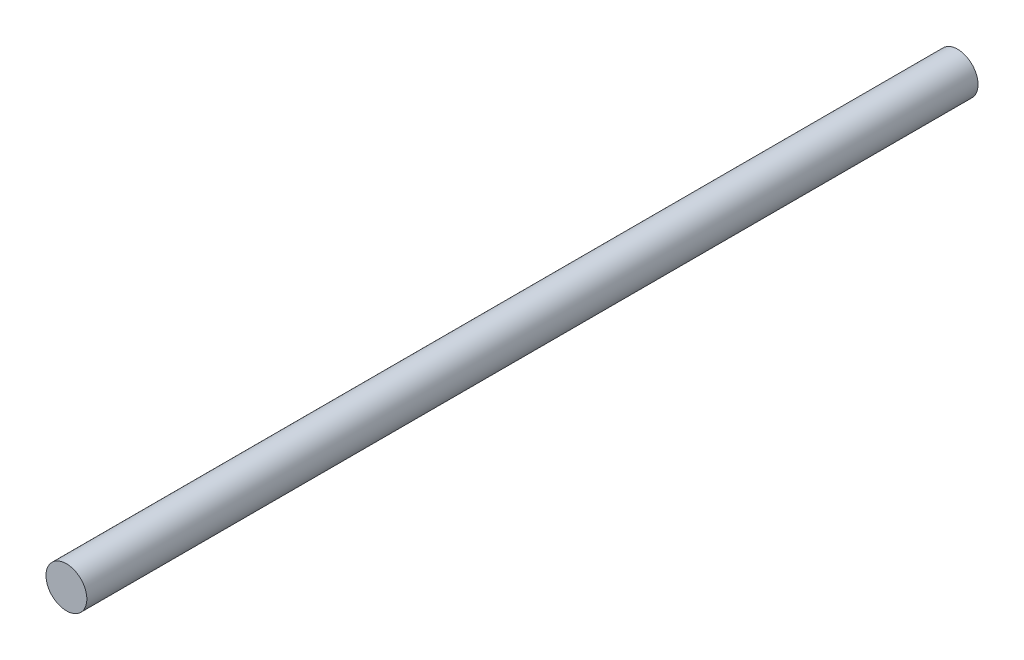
ISO-10303-21;
HEADER;
FILE_DESCRIPTION(('STEP AP214'),'2;1');
FILE_NAME('part.step','',(''),(''),'','','');
FILE_SCHEMA(('AUTOMOTIVE_DESIGN { 1 0 10303 214 1 1 1 1 }'));
ENDSEC;
DATA;
#1=APPLICATION_CONTEXT('core data for automotive mechanical design processes');
#2=APPLICATION_PROTOCOL_DEFINITION('international standard','automotive_design',2000,#1);
#3=PRODUCT_CONTEXT('',#1,'mechanical');
#4=PRODUCT('Part','Part','',(#3));
#5=PRODUCT_RELATED_PRODUCT_CATEGORY('part','',(#4));
#6=PRODUCT_DEFINITION_FORMATION('','',#4);
#7=PRODUCT_DEFINITION_CONTEXT('part definition',#1,'design');
#8=PRODUCT_DEFINITION('design','',#6,#7);
#9=PRODUCT_DEFINITION_SHAPE('','',#8);
#10=(LENGTH_UNIT() NAMED_UNIT(*) SI_UNIT(.MILLI.,.METRE.));
#11=(NAMED_UNIT(*) PLANE_ANGLE_UNIT() SI_UNIT($,.RADIAN.));
#12=(NAMED_UNIT(*) SI_UNIT($,.STERADIAN.) SOLID_ANGLE_UNIT());
#13=UNCERTAINTY_MEASURE_WITH_UNIT(LENGTH_MEASURE(1.E-05),#10,'distance_accuracy_value','');
#14=(GEOMETRIC_REPRESENTATION_CONTEXT(3) GLOBAL_UNCERTAINTY_ASSIGNED_CONTEXT((#13)) GLOBAL_UNIT_ASSIGNED_CONTEXT((#10,
#11,#12)) REPRESENTATION_CONTEXT('',''));
#15=CARTESIAN_POINT('',(0.,0.,0.));
#16=DIRECTION('',(0.,0.,1.));
#17=DIRECTION('',(1.,0.,0.));
#18=AXIS2_PLACEMENT_3D('',#15,#16,#17);
#19=CARTESIAN_POINT('',(0.,0.,398.4625));
#20=DIRECTION('',(0.,0.,-1.));
#21=DIRECTION('',(-1.,0.,0.));
#22=AXIS2_PLACEMENT_3D('',#19,#20,#21);
#23=CYLINDRICAL_SURFACE('',#22,18.2626);
#24=CARTESIAN_POINT('',(0.,0.,398.4625));
#25=DIRECTION('',(0.,0.,1.));
#26=DIRECTION('',(1.,0.,0.));
#27=AXIS2_PLACEMENT_3D('',#24,#25,#26);
#28=CIRCLE('',#27,18.2626);
#29=CARTESIAN_POINT('',(-18.2626,0.,398.4625));
#30=VERTEX_POINT('',#29);
#31=EDGE_CURVE('E10',#30,#30,#28,.T.);
#32=CARTESIAN_POINT('',(0.,0.,-398.4625));
#33=DIRECTION('',(0.,0.,1.));
#34=DIRECTION('',(1.,0.,0.));
#35=AXIS2_PLACEMENT_3D('',#32,#33,#34);
#36=CIRCLE('',#35,18.2626);
#37=CARTESIAN_POINT('',(-18.2626,0.,-398.4625));
#38=VERTEX_POINT('',#37);
#39=EDGE_CURVE('E33',#38,#38,#36,.T.);
#40=CARTESIAN_POINT('',(-18.2626,0.,398.4625));
#41=CARTESIAN_POINT('',(-18.2626,0.,390.161197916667));
#42=CARTESIAN_POINT('',(-18.2626,0.,381.859895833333));
#43=CARTESIAN_POINT('',(-18.2626,0.,365.257291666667));
#44=CARTESIAN_POINT('',(-18.2626,0.,356.955989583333));
#45=CARTESIAN_POINT('',(-18.2626,0.,340.353385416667));
#46=CARTESIAN_POINT('',(-18.2626,0.,332.052083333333));
#47=CARTESIAN_POINT('',(-18.2626,0.,315.449479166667));
#48=CARTESIAN_POINT('',(-18.2626,0.,307.148177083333));
#49=CARTESIAN_POINT('',(-18.2626,0.,290.545572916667));
#50=CARTESIAN_POINT('',(-18.2626,0.,282.244270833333));
#51=CARTESIAN_POINT('',(-18.2626,0.,265.641666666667));
#52=CARTESIAN_POINT('',(-18.2626,0.,257.340364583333));
#53=CARTESIAN_POINT('',(-18.2626,0.,240.737760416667));
#54=CARTESIAN_POINT('',(-18.2626,0.,232.436458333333));
#55=CARTESIAN_POINT('',(-18.2626,0.,215.833854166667));
#56=CARTESIAN_POINT('',(-18.2626,0.,207.532552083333));
#57=CARTESIAN_POINT('',(-18.2626,0.,190.929947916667));
#58=CARTESIAN_POINT('',(-18.2626,0.,182.628645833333));
#59=CARTESIAN_POINT('',(-18.2626,0.,166.026041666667));
#60=CARTESIAN_POINT('',(-18.2626,0.,157.724739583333));
#61=CARTESIAN_POINT('',(-18.2626,0.,141.122135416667));
#62=CARTESIAN_POINT('',(-18.2626,0.,132.820833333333));
#63=CARTESIAN_POINT('',(-18.2626,0.,116.218229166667));
#64=CARTESIAN_POINT('',(-18.2626,0.,107.916927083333));
#65=CARTESIAN_POINT('',(-18.2626,0.,91.3143229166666));
#66=CARTESIAN_POINT('',(-18.2626,0.,83.0130208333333));
#67=CARTESIAN_POINT('',(-18.2626,0.,66.4104166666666));
#68=CARTESIAN_POINT('',(-18.2626,0.,58.1091145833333));
#69=CARTESIAN_POINT('',(-18.2626,0.,41.5065104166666));
#70=CARTESIAN_POINT('',(-18.2626,0.,33.2052083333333));
#71=CARTESIAN_POINT('',(-18.2626,0.,16.6026041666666));
#72=CARTESIAN_POINT('',(-18.2626,0.,8.30130208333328));
#73=CARTESIAN_POINT('',(-18.2626,0.,-8.30130208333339));
#74=CARTESIAN_POINT('',(-18.2626,0.,-16.6026041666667));
#75=CARTESIAN_POINT('',(-18.2626,0.,-33.2052083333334));
#76=CARTESIAN_POINT('',(-18.2626,0.,-41.5065104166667));
#77=CARTESIAN_POINT('',(-18.2626,0.,-58.1091145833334));
#78=CARTESIAN_POINT('',(-18.2626,0.,-66.4104166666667));
#79=CARTESIAN_POINT('',(-18.2626,0.,-83.0130208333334));
#80=CARTESIAN_POINT('',(-18.2626,0.,-91.3143229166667));
#81=CARTESIAN_POINT('',(-18.2626,0.,-107.916927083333));
#82=CARTESIAN_POINT('',(-18.2626,0.,-116.218229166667));
#83=CARTESIAN_POINT('',(-18.2626,0.,-132.820833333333));
#84=CARTESIAN_POINT('',(-18.2626,0.,-141.122135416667));
#85=CARTESIAN_POINT('',(-18.2626,0.,-157.724739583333));
#86=CARTESIAN_POINT('',(-18.2626,0.,-166.026041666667));
#87=CARTESIAN_POINT('',(-18.2626,0.,-182.628645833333));
#88=CARTESIAN_POINT('',(-18.2626,0.,-190.929947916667));
#89=CARTESIAN_POINT('',(-18.2626,0.,-207.532552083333));
#90=CARTESIAN_POINT('',(-18.2626,0.,-215.833854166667));
#91=CARTESIAN_POINT('',(-18.2626,0.,-232.436458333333));
#92=CARTESIAN_POINT('',(-18.2626,0.,-240.737760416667));
#93=CARTESIAN_POINT('',(-18.2626,0.,-257.340364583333));
#94=CARTESIAN_POINT('',(-18.2626,0.,-265.641666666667));
#95=CARTESIAN_POINT('',(-18.2626,0.,-282.244270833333));
#96=CARTESIAN_POINT('',(-18.2626,0.,-290.545572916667));
#97=CARTESIAN_POINT('',(-18.2626,0.,-307.148177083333));
#98=CARTESIAN_POINT('',(-18.2626,0.,-315.449479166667));
#99=CARTESIAN_POINT('',(-18.2626,0.,-332.052083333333));
#100=CARTESIAN_POINT('',(-18.2626,0.,-340.353385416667));
#101=CARTESIAN_POINT('',(-18.2626,0.,-356.955989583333));
#102=CARTESIAN_POINT('',(-18.2626,0.,-365.257291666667));
#103=CARTESIAN_POINT('',(-18.2626,0.,-381.859895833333));
#104=CARTESIAN_POINT('',(-18.2626,0.,-390.161197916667));
#105=CARTESIAN_POINT('',(-18.2626,0.,-398.4625));
#106=B_SPLINE_CURVE_WITH_KNOTS('',3,(#40,#41,#42,#43,#44,#45,#46,#47,#48,#49,#50,#51,#52,#53,
#54,#55,#56,#57,#58,#59,#60,#61,#62,#63,#64,#65,#66,#67,#68,#69,#70,#71,#72,#73,#74,#75,#76,#77,
#78,#79,#80,#81,#82,#83,#84,#85,#86,#87,#88,#89,#90,#91,#92,#93,#94,#95,#96,#97,#98,#99,#100,
#101,#102,#103,#104,#105),.UNSPECIFIED.,.F.,.F.,(4,2,2,2,2,2,2,2,2,2,2,2,2,2,2,2,2,2,2,2,2,2,2,
2,2,2,2,2,2,2,2,2,4),(0.,24.90390625,49.8078125,74.71171875,99.615625,124.51953125,149.4234375,
174.32734375,199.23125,224.13515625,249.0390625,273.94296875,298.846875,323.75078125,
348.6546875,373.55859375,398.4625,423.36640625,448.2703125,473.17421875,498.078125,522.98203125,
547.8859375,572.78984375,597.69375,622.59765625,647.5015625,672.40546875,697.309375,
722.21328125,747.1171875,772.02109375,796.925),.UNSPECIFIED.);
#107=EDGE_CURVE('BSEAM30',#30,#38,#106,.T.);
#108=ORIENTED_EDGE('',*,*,#31,.F.);
#109=ORIENTED_EDGE('',*,*,#39,.T.);
#110=ORIENTED_EDGE('',*,*,#107,.T.);
#111=ORIENTED_EDGE('',*,*,#107,.F.);
#112=EDGE_LOOP('',(#108,#110,#109,#111));
#113=FACE_BOUND('',#112,.T.);
#114=ADVANCED_FACE('F30',(#113),#23,.T.);
#115=CARTESIAN_POINT('',(0.,0.,398.4625));
#116=DIRECTION('',(0.,0.,1.));
#117=DIRECTION('',(1.,0.,0.));
#118=AXIS2_PLACEMENT_3D('',#115,#116,#117);
#119=PLANE('',#118);
#120=ORIENTED_EDGE('',*,*,#31,.T.);
#121=EDGE_LOOP('',(#120));
#122=FACE_BOUND('',#121,.T.);
#123=ADVANCED_FACE('F45',(#122),#119,.T.);
#124=CARTESIAN_POINT('',(0.,0.,-398.4625));
#125=DIRECTION('',(0.,0.,1.));
#126=DIRECTION('',(1.,0.,0.));
#127=AXIS2_PLACEMENT_3D('',#124,#125,#126);
#128=PLANE('',#127);
#129=ORIENTED_EDGE('',*,*,#39,.F.);
#130=EDGE_LOOP('',(#129));
#131=FACE_BOUND('',#130,.T.);
#132=ADVANCED_FACE('F43',(#131),#128,.F.);
#133=CLOSED_SHELL('',(#114,#123,#132));
#134=MANIFOLD_SOLID_BREP('B2',#133);
#135=ADVANCED_BREP_SHAPE_REPRESENTATION('',(#18,#134),#14);
#136=SHAPE_DEFINITION_REPRESENTATION(#9,#135);
ENDSEC;
END-ISO-10303-21;
